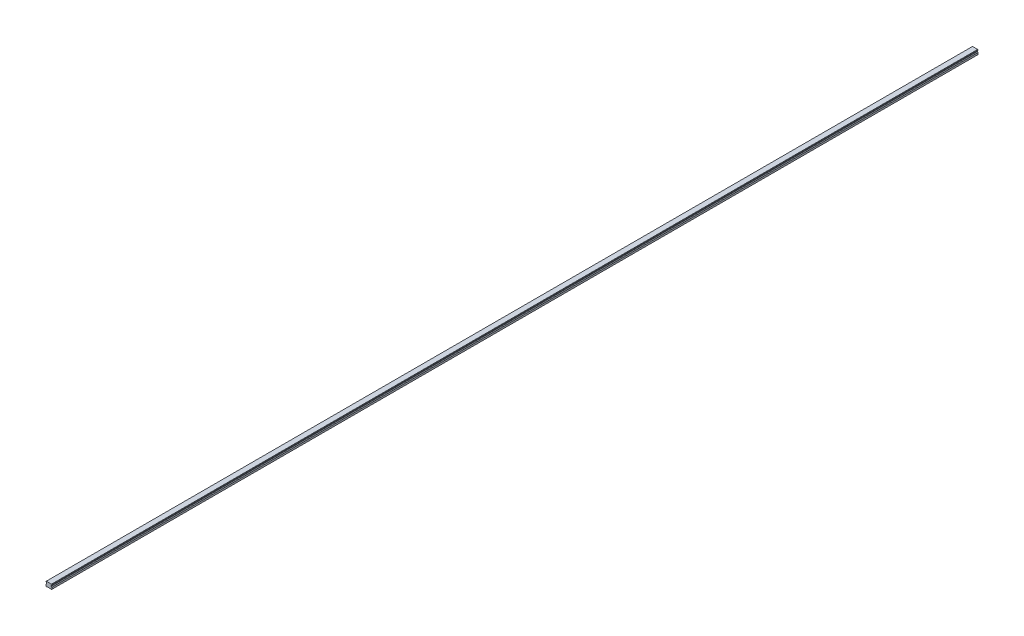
from build123d import *

# Parameters (mm, degrees)
SKETCH1_W           = 20
SKETCH1_H           = 16.3
BOSS_EXTRUDE1_DEPTH = 1610
CUT_EXTRUDE1_DEPTH  = 3221.056783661
CHAMFER1_SIZE       = 1
FILLET1_R           = 1
CUT_EXTRUDE2_DEPTH  = 3221.056783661
SKETCH5_R           = 3
SKETCH5_R_2         = 2.5
CUT_EXTRUDE5_DEPTH  = 10
SKETCH5_2_R         = 2.5
CUT_EXTRUDE6_DEPTH  = 13
LPATTERN2_COUNT     = 54
LPATTERN2_PITCH     = 60


with BuildPart() as part:
    # Sketch1 → Boss-Extrude1 (new, symmetric)
    with BuildSketch(Plane.XY):
        with Locations((0, 8.15)):
            Rectangle(SKETCH1_W, SKETCH1_H)
    extrude(amount=BOSS_EXTRUDE1_DEPTH, both=True)

    # Sketch2 → Cut-Extrude1 (cut, through all)
    with BuildSketch(Plane.XY.offset(1610)):
        Polygon((-10, 14.3), (-10, 7.3), (-7.666666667, 9.633333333), (-7.666666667, 11.966666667), align=None)
        Polygon((7.666666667, 11.966666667), (10, 14.3), (10, 7.3), (7.666666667, 9.633333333), align=None)
    extrude(amount=-CUT_EXTRUDE1_DEPTH, mode=Mode.SUBTRACT)

    # Chamfer1
    chamfer1_edges = [part.edges().sort_by_distance(p)[0] for p in [
        (-10, 16.3, 0),
        (10, 16.3, 0),
        (10, 0, 0),
        (-10, 0, 0),
    ]]
    chamfer(chamfer1_edges, length=CHAMFER1_SIZE)

    # Fillet1
    fillet1_edges = [part.edges().sort_by_distance(p)[0] for p in [
        (-7.666666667, 11.966666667, 0),
        (-7.666666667, 9.633333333, 0),
        (7.666666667, 9.633333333, 0),
        (7.666666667, 11.966666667, 0),
    ]]
    fillet(fillet1_edges, radius=FILLET1_R)

    # Sketch3 → Cut-Extrude2 (cut, through all)
    with BuildSketch(Plane.XY.offset(1610)):
        Polygon((-6, 0), (-5, 1), (5, 1), (6, 0), align=None)
    extrude(amount=-CUT_EXTRUDE2_DEPTH, mode=Mode.SUBTRACT)

    # Sketch5 → Cut-Extrude5 (cut)
    with BuildSketch(Plane.XZ.offset(-1)):
        with Locations(Location((0, 1590, 0), (0, 0, 270))):
            Circle(SKETCH5_R)
        with Locations(Location((0, 1590, 0), (0, 0, 270))):
            Circle(SKETCH5_R_2, mode=Mode.SUBTRACT)
    cut_extrude5 = extrude(amount=-CUT_EXTRUDE5_DEPTH, mode=Mode.SUBTRACT)

    # Sketch5_2 → Cut-Extrude6 (cut)
    with BuildSketch(Plane.XZ.offset(-1)):
        with Locations(Location((0, 1590, 0), (0, 0, 270))):
            Circle(SKETCH5_2_R)
    cut_extrude6 = extrude(amount=-CUT_EXTRUDE6_DEPTH, mode=Mode.SUBTRACT)

    # Cut-Extrude7 cone 1 section (on through the dimple's axis) → Cut-Extrude7 (revolve, cut)
    with BuildSketch(Plane(origin=(0, 14, 1590), x_dir=(0, 0, -1), z_dir=(1, 0, 0))):
        Polygon((0, 0), (2.5, 0), (0, 1.443375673), align=None)
    cut_extrude7 = revolve(axis=Axis((0, 14, 1590), (0, 1, 0)), mode=Mode.SUBTRACT)

    # LPattern2: Cut-Extrude5, Cut-Extrude6, Cut-Extrude7 ×54
    with Locations(*[(0, 0, -i * LPATTERN2_PITCH) for i in range(1, LPATTERN2_COUNT)]):
        add(cut_extrude5, mode=Mode.SUBTRACT)
        add(cut_extrude6, mode=Mode.SUBTRACT)
        add(cut_extrude7, mode=Mode.SUBTRACT)


solid = part.part
